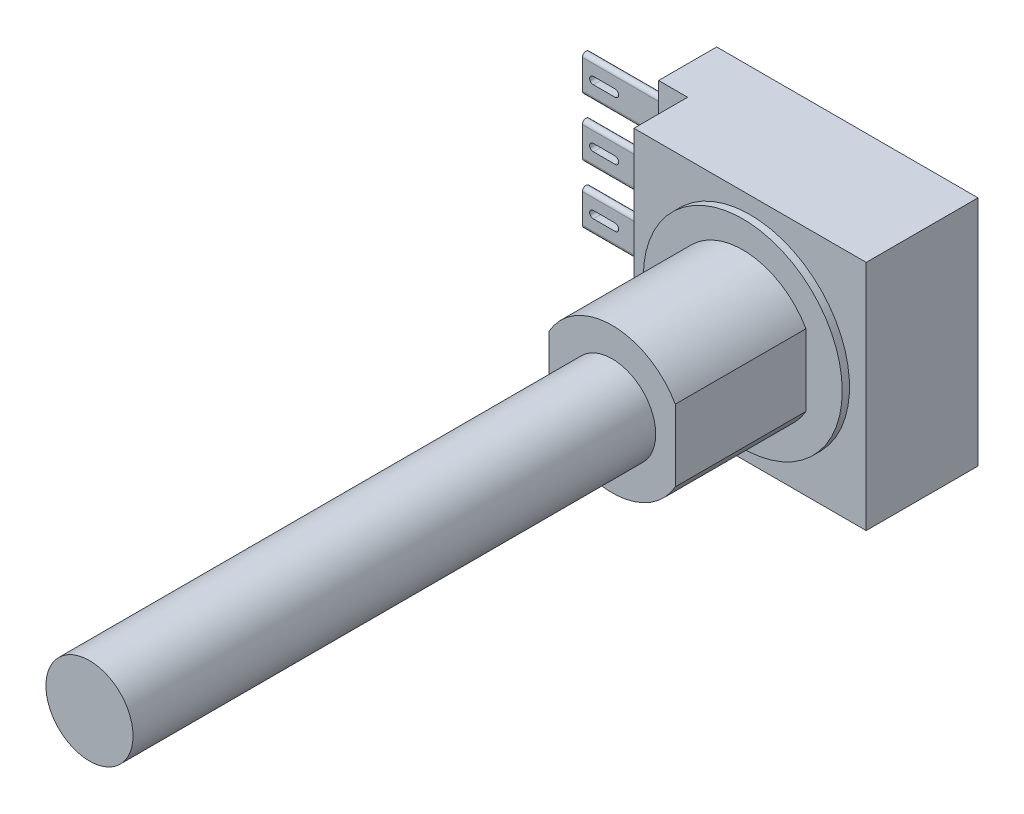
ISO-10303-21;
HEADER;
FILE_DESCRIPTION(('STEP AP214'),'2;1');
FILE_NAME('part.step','',(''),(''),'','','');
FILE_SCHEMA(('AUTOMOTIVE_DESIGN { 1 0 10303 214 1 1 1 1 }'));
ENDSEC;
DATA;
#1=APPLICATION_CONTEXT('core data for automotive mechanical design processes');
#2=APPLICATION_PROTOCOL_DEFINITION('international standard','automotive_design',2000,#1);
#3=PRODUCT_CONTEXT('',#1,'mechanical');
#4=PRODUCT('Part','Part','',(#3));
#5=PRODUCT_RELATED_PRODUCT_CATEGORY('part','',(#4));
#6=PRODUCT_DEFINITION_FORMATION('','',#4);
#7=PRODUCT_DEFINITION_CONTEXT('part definition',#1,'design');
#8=PRODUCT_DEFINITION('design','',#6,#7);
#9=PRODUCT_DEFINITION_SHAPE('','',#8);
#10=(LENGTH_UNIT() NAMED_UNIT(*) SI_UNIT(.MILLI.,.METRE.));
#11=(NAMED_UNIT(*) PLANE_ANGLE_UNIT() SI_UNIT($,.RADIAN.));
#12=(NAMED_UNIT(*) SI_UNIT($,.STERADIAN.) SOLID_ANGLE_UNIT());
#13=UNCERTAINTY_MEASURE_WITH_UNIT(LENGTH_MEASURE(1.E-05),#10,'distance_accuracy_value','');
#14=(GEOMETRIC_REPRESENTATION_CONTEXT(3) GLOBAL_UNCERTAINTY_ASSIGNED_CONTEXT((#13)) GLOBAL_UNIT_ASSIGNED_CONTEXT((#10,
#11,#12)) REPRESENTATION_CONTEXT('',''));
#15=CARTESIAN_POINT('',(0.,0.,0.));
#16=DIRECTION('',(0.,0.,1.));
#17=DIRECTION('',(1.,0.,0.));
#18=AXIS2_PLACEMENT_3D('',#15,#16,#17);
#19=CARTESIAN_POINT('',(-20.8042237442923,3.17549019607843,4.));
#20=DIRECTION('',(1.,0.,0.));
#21=DIRECTION('',(0.,1.,0.));
#22=AXIS2_PLACEMENT_3D('',#19,#20,#21);
#23=PLANE('',#22);
#24=CARTESIAN_POINT('',(-20.8042237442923,0.175490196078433,2.));
#25=DIRECTION('',(-1.,0.,0.));
#26=DIRECTION('',(0.,-1.,0.));
#27=AXIS2_PLACEMENT_3D('',#24,#25,#26);
#28=CIRCLE('',#27,0.25);
#29=CARTESIAN_POINT('',(-20.8042237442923,0.175490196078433,2.25));
#30=VERTEX_POINT('',#29);
#31=CARTESIAN_POINT('',(-20.8042237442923,0.175490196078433,1.75));
#32=VERTEX_POINT('',#31);
#33=EDGE_CURVE('E392',#30,#32,#28,.T.);
#34=ORIENTED_EDGE('',*,*,#33,.F.);
#35=DIRECTION('',(0.,1.,0.));
#36=VECTOR('',#35,1.);
#37=CARTESIAN_POINT('',(-20.8042237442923,0.175490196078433,2.25));
#38=LINE('',#37,#36);
#39=CARTESIAN_POINT('',(-20.8042237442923,-1.82450980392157,2.25));
#40=VERTEX_POINT('',#39);
#41=EDGE_CURVE('E397',#40,#30,#38,.T.);
#42=ORIENTED_EDGE('',*,*,#41,.F.);
#43=CARTESIAN_POINT('',(-20.8042237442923,-1.82450980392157,2.));
#44=DIRECTION('',(-1.,0.,0.));
#45=DIRECTION('',(0.,-1.,0.));
#46=AXIS2_PLACEMENT_3D('',#43,#44,#45);
#47=CIRCLE('',#46,0.25);
#48=CARTESIAN_POINT('',(-20.8042237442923,-1.82450980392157,1.75));
#49=VERTEX_POINT('',#48);
#50=EDGE_CURVE('E409',#49,#40,#47,.T.);
#51=ORIENTED_EDGE('',*,*,#50,.F.);
#52=DIRECTION('',(0.,-1.,0.));
#53=VECTOR('',#52,1.);
#54=CARTESIAN_POINT('',(-20.8042237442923,0.175490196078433,1.75));
#55=LINE('',#54,#53);
#56=EDGE_CURVE('E406',#32,#49,#55,.T.);
#57=ORIENTED_EDGE('',*,*,#56,.F.);
#58=EDGE_LOOP('',(#34,#42,#51,#57));
#59=FACE_BOUND('',#58,.T.);
#60=DIRECTION('',(0.,-1.,0.));
#61=VECTOR('',#60,1.);
#62=CARTESIAN_POINT('',(-20.8042237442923,3.17549019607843,0.));
#63=LINE('',#62,#61);
#64=CARTESIAN_POINT('',(-20.8042237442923,3.17549019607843,0.));
#65=VERTEX_POINT('',#64);
#66=CARTESIAN_POINT('',(-20.8042237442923,-12.8245098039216,0.));
#67=VERTEX_POINT('',#66);
#68=EDGE_CURVE('E515',#65,#67,#63,.T.);
#69=ORIENTED_EDGE('',*,*,#68,.T.);
#70=DIRECTION('',(0.,0.,-1.));
#71=VECTOR('',#70,1.);
#72=CARTESIAN_POINT('',(-20.8042237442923,-12.8245098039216,4.));
#73=LINE('',#72,#71);
#74=CARTESIAN_POINT('',(-20.8042237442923,-12.8245098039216,4.));
#75=VERTEX_POINT('',#74);
#76=EDGE_CURVE('E522',#75,#67,#73,.T.);
#77=ORIENTED_EDGE('',*,*,#76,.F.);
#78=DIRECTION('',(0.,-1.,0.));
#79=VECTOR('',#78,1.);
#80=CARTESIAN_POINT('',(-20.8042237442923,3.17549019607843,4.));
#81=LINE('',#80,#79);
#82=CARTESIAN_POINT('',(-20.8042237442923,3.17549019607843,4.));
#83=VERTEX_POINT('',#82);
#84=EDGE_CURVE('E499',#83,#75,#81,.T.);
#85=ORIENTED_EDGE('',*,*,#84,.F.);
#86=DIRECTION('',(0.,0.,-1.));
#87=VECTOR('',#86,1.);
#88=CARTESIAN_POINT('',(-20.8042237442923,3.17549019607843,4.));
#89=LINE('',#88,#87);
#90=EDGE_CURVE('E1025',#83,#65,#89,.T.);
#91=ORIENTED_EDGE('',*,*,#90,.T.);
#92=EDGE_LOOP('',(#69,#77,#85,#91));
#93=FACE_BOUND('',#92,.T.);
#94=CARTESIAN_POINT('',(-20.8042237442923,-3.82450980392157,2.));
#95=DIRECTION('',(-1.,0.,0.));
#96=DIRECTION('',(0.,-1.,0.));
#97=AXIS2_PLACEMENT_3D('',#94,#95,#96);
#98=CIRCLE('',#97,0.25);
#99=CARTESIAN_POINT('',(-20.8042237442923,-3.82450980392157,2.25));
#100=VERTEX_POINT('',#99);
#101=CARTESIAN_POINT('',(-20.8042237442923,-3.82450980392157,1.75));
#102=VERTEX_POINT('',#101);
#103=EDGE_CURVE('E425',#100,#102,#98,.T.);
#104=ORIENTED_EDGE('',*,*,#103,.F.);
#105=DIRECTION('',(0.,1.,0.));
#106=VECTOR('',#105,1.);
#107=CARTESIAN_POINT('',(-20.8042237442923,-3.82450980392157,2.25));
#108=LINE('',#107,#106);
#109=CARTESIAN_POINT('',(-20.8042237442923,-5.82450980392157,2.25));
#110=VERTEX_POINT('',#109);
#111=EDGE_CURVE('E430',#110,#100,#108,.T.);
#112=ORIENTED_EDGE('',*,*,#111,.F.);
#113=CARTESIAN_POINT('',(-20.8042237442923,-5.82450980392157,2.));
#114=DIRECTION('',(-1.,0.,0.));
#115=DIRECTION('',(0.,-1.,0.));
#116=AXIS2_PLACEMENT_3D('',#113,#114,#115);
#117=CIRCLE('',#116,0.25);
#118=CARTESIAN_POINT('',(-20.8042237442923,-5.82450980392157,1.75));
#119=VERTEX_POINT('',#118);
#120=EDGE_CURVE('E442',#119,#110,#117,.T.);
#121=ORIENTED_EDGE('',*,*,#120,.F.);
#122=DIRECTION('',(0.,-1.,0.));
#123=VECTOR('',#122,1.);
#124=CARTESIAN_POINT('',(-20.8042237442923,-3.82450980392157,1.75));
#125=LINE('',#124,#123);
#126=EDGE_CURVE('E439',#102,#119,#125,.T.);
#127=ORIENTED_EDGE('',*,*,#126,.F.);
#128=EDGE_LOOP('',(#104,#112,#121,#127));
#129=FACE_BOUND('',#128,.T.);
#130=CARTESIAN_POINT('',(-20.8042237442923,-7.82450980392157,2.));
#131=DIRECTION('',(-1.,0.,0.));
#132=DIRECTION('',(0.,-1.,0.));
#133=AXIS2_PLACEMENT_3D('',#130,#131,#132);
#134=CIRCLE('',#133,0.250000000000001);
#135=CARTESIAN_POINT('',(-20.8042237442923,-7.82450980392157,2.25));
#136=VERTEX_POINT('',#135);
#137=CARTESIAN_POINT('',(-20.8042237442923,-7.82450980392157,1.75));
#138=VERTEX_POINT('',#137);
#139=EDGE_CURVE('E359',#136,#138,#134,.T.);
#140=ORIENTED_EDGE('',*,*,#139,.F.);
#141=DIRECTION('',(0.,1.,0.));
#142=VECTOR('',#141,1.);
#143=CARTESIAN_POINT('',(-20.8042237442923,-7.82450980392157,2.25));
#144=LINE('',#143,#142);
#145=CARTESIAN_POINT('',(-20.8042237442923,-9.82450980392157,2.25));
#146=VERTEX_POINT('',#145);
#147=EDGE_CURVE('E364',#146,#136,#144,.T.);
#148=ORIENTED_EDGE('',*,*,#147,.F.);
#149=CARTESIAN_POINT('',(-20.8042237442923,-9.82450980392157,2.));
#150=DIRECTION('',(-1.,0.,0.));
#151=DIRECTION('',(0.,-1.,0.));
#152=AXIS2_PLACEMENT_3D('',#149,#150,#151);
#153=CIRCLE('',#152,0.25);
#154=CARTESIAN_POINT('',(-20.8042237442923,-9.82450980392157,1.75));
#155=VERTEX_POINT('',#154);
#156=EDGE_CURVE('E376',#155,#146,#153,.T.);
#157=ORIENTED_EDGE('',*,*,#156,.F.);
#158=DIRECTION('',(0.,-1.,0.));
#159=VECTOR('',#158,1.);
#160=CARTESIAN_POINT('',(-20.8042237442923,-7.82450980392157,1.75));
#161=LINE('',#160,#159);
#162=EDGE_CURVE('E373',#138,#155,#161,.T.);
#163=ORIENTED_EDGE('',*,*,#162,.F.);
#164=EDGE_LOOP('',(#140,#148,#157,#163));
#165=FACE_BOUND('',#164,.T.);
#166=ADVANCED_FACE('F38',(#59,#93,#129,#165),#23,.F.);
#167=CARTESIAN_POINT('',(-10.8042237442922,-4.82450980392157,17.2));
#168=DIRECTION('',(0.,0.,1.));
#169=DIRECTION('',(1.,0.,0.));
#170=AXIS2_PLACEMENT_3D('',#167,#168,#169);
#171=PLANE('',#170);
#172=CARTESIAN_POINT('',(-10.8042237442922,-4.82450980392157,17.2));
#173=DIRECTION('',(0.,0.,1.));
#174=DIRECTION('',(1.,0.,0.));
#175=AXIS2_PLACEMENT_3D('',#172,#173,#174);
#176=CIRCLE('',#175,3.);
#177=CARTESIAN_POINT('',(-7.80422374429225,-4.82450980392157,17.2));
#178=VERTEX_POINT('',#177);
#179=EDGE_CURVE('E461',#178,#178,#176,.T.);
#180=ORIENTED_EDGE('',*,*,#179,.F.);
#181=EDGE_LOOP('',(#180));
#182=FACE_BOUND('',#181,.T.);
#183=CARTESIAN_POINT('',(-10.8042237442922,-4.82450980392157,17.2));
#184=DIRECTION('',(0.,0.,1.));
#185=DIRECTION('',(1.,0.,0.));
#186=AXIS2_PLACEMENT_3D('',#183,#184,#185);
#187=CIRCLE('',#186,5.);
#188=CARTESIAN_POINT('',(-15.1542237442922,-7.28976841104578,17.2));
#189=VERTEX_POINT('',#188);
#190=CARTESIAN_POINT('',(-6.45422374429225,-7.28976841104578,17.2));
#191=VERTEX_POINT('',#190);
#192=EDGE_CURVE('E479',#189,#191,#187,.T.);
#193=ORIENTED_EDGE('',*,*,#192,.T.);
#194=DIRECTION('',(0.,1.,0.));
#195=VECTOR('',#194,1.);
#196=CARTESIAN_POINT('',(-6.45422374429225,0.675490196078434,17.2));
#197=LINE('',#196,#195);
#198=CARTESIAN_POINT('',(-6.45422374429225,-2.35925119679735,17.2));
#199=VERTEX_POINT('',#198);
#200=EDGE_CURVE('E464',#191,#199,#197,.T.);
#201=ORIENTED_EDGE('',*,*,#200,.T.);
#202=CARTESIAN_POINT('',(-15.1542237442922,-2.35925119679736,17.2));
#203=VERTEX_POINT('',#202);
#204=EDGE_CURVE('E475',#199,#203,#187,.T.);
#205=ORIENTED_EDGE('',*,*,#204,.T.);
#206=DIRECTION('',(0.,-1.,0.));
#207=VECTOR('',#206,1.);
#208=CARTESIAN_POINT('',(-15.1542237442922,0.675490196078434,17.2));
#209=LINE('',#208,#207);
#210=EDGE_CURVE('E458',#203,#189,#209,.T.);
#211=ORIENTED_EDGE('',*,*,#210,.T.);
#212=EDGE_LOOP('',(#193,#201,#205,#211));
#213=FACE_BOUND('',#212,.T.);
#214=ADVANCED_FACE('F535',(#182,#213),#171,.T.);
#215=CARTESIAN_POINT('',(-10.8042237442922,-4.82450980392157,17.2));
#216=DIRECTION('',(0.,0.,-1.));
#217=DIRECTION('',(-1.,0.,0.));
#218=AXIS2_PLACEMENT_3D('',#215,#216,#217);
#219=CYLINDRICAL_SURFACE('',#218,5.);
#220=DIRECTION('',(0.,0.,-1.));
#221=VECTOR('',#220,1.);
#222=CARTESIAN_POINT('',(-6.45422374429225,-7.28976841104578,17.2));
#223=LINE('',#222,#221);
#224=CARTESIAN_POINT('',(-6.45422374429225,-7.28976841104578,8.2));
#225=VERTEX_POINT('',#224);
#226=EDGE_CURVE('E12',#191,#225,#223,.T.);
#227=ORIENTED_EDGE('',*,*,#226,.F.);
#228=ORIENTED_EDGE('',*,*,#192,.F.);
#229=DIRECTION('',(0.,0.,-1.));
#230=VECTOR('',#229,1.);
#231=CARTESIAN_POINT('',(-15.1542237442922,-7.28976841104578,17.2));
#232=LINE('',#231,#230);
#233=CARTESIAN_POINT('',(-15.1542237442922,-7.28976841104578,8.2));
#234=VERTEX_POINT('',#233);
#235=EDGE_CURVE('E521',#234,#189,#232,.F.);
#236=ORIENTED_EDGE('',*,*,#235,.F.);
#237=CARTESIAN_POINT('',(-10.8042237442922,-4.82450980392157,8.2));
#238=DIRECTION('',(0.,0.,1.));
#239=DIRECTION('',(1.,0.,0.));
#240=AXIS2_PLACEMENT_3D('',#237,#238,#239);
#241=CIRCLE('',#240,5.);
#242=EDGE_CURVE('E472',#234,#225,#241,.T.);
#243=ORIENTED_EDGE('',*,*,#242,.T.);
#244=EDGE_LOOP('',(#227,#228,#236,#243));
#245=FACE_BOUND('',#244,.T.);
#246=ADVANCED_FACE('F543',(#245),#219,.T.);
#247=DIRECTION('',(0.,0.,-1.));
#248=VECTOR('',#247,1.);
#249=CARTESIAN_POINT('',(-6.45422374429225,-2.35925119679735,17.2));
#250=LINE('',#249,#248);
#251=CARTESIAN_POINT('',(-6.45422374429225,-2.35925119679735,8.2));
#252=VERTEX_POINT('',#251);
#253=EDGE_CURVE('E45',#252,#199,#250,.F.);
#254=ORIENTED_EDGE('',*,*,#253,.F.);
#255=CARTESIAN_POINT('',(-15.1542237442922,-2.35925119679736,8.2));
#256=VERTEX_POINT('',#255);
#257=EDGE_CURVE('E480',#252,#256,#241,.T.);
#258=ORIENTED_EDGE('',*,*,#257,.T.);
#259=DIRECTION('',(0.,0.,-1.));
#260=VECTOR('',#259,1.);
#261=CARTESIAN_POINT('',(-15.1542237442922,-2.35925119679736,17.2));
#262=LINE('',#261,#260);
#263=EDGE_CURVE('E524',#203,#256,#262,.T.);
#264=ORIENTED_EDGE('',*,*,#263,.F.);
#265=ORIENTED_EDGE('',*,*,#204,.F.);
#266=EDGE_LOOP('',(#254,#258,#264,#265));
#267=FACE_BOUND('',#266,.T.);
#268=ADVANCED_FACE('F538',(#267),#219,.T.);
#269=CARTESIAN_POINT('',(-10.8042237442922,-4.82450980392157,8.2));
#270=DIRECTION('',(0.,0.,1.));
#271=DIRECTION('',(1.,0.,0.));
#272=AXIS2_PLACEMENT_3D('',#269,#270,#271);
#273=PLANE('',#272);
#274=DIRECTION('',(0.,-1.,0.));
#275=VECTOR('',#274,1.);
#276=CARTESIAN_POINT('',(-6.45422374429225,0.675490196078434,8.2));
#277=LINE('',#276,#275);
#278=EDGE_CURVE('E459',#252,#225,#277,.T.);
#279=ORIENTED_EDGE('',*,*,#278,.T.);
#280=ORIENTED_EDGE('',*,*,#242,.F.);
#281=DIRECTION('',(0.,1.,0.));
#282=VECTOR('',#281,1.);
#283=CARTESIAN_POINT('',(-15.1542237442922,0.675490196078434,8.2));
#284=LINE('',#283,#282);
#285=EDGE_CURVE('E462',#234,#256,#284,.T.);
#286=ORIENTED_EDGE('',*,*,#285,.T.);
#287=ORIENTED_EDGE('',*,*,#257,.F.);
#288=EDGE_LOOP('',(#279,#280,#286,#287));
#289=FACE_BOUND('',#288,.T.);
#290=CARTESIAN_POINT('',(-10.8042237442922,-4.82450980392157,8.2));
#291=DIRECTION('',(0.,0.,1.));
#292=DIRECTION('',(1.,0.,0.));
#293=AXIS2_PLACEMENT_3D('',#290,#291,#292);
#294=CIRCLE('',#293,6.85);
#295=CARTESIAN_POINT('',(-3.95422374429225,-4.82450980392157,8.2));
#296=VERTEX_POINT('',#295);
#297=EDGE_CURVE('E478',#296,#296,#294,.T.);
#298=ORIENTED_EDGE('',*,*,#297,.T.);
#299=EDGE_LOOP('',(#298));
#300=FACE_BOUND('',#299,.T.);
#301=ADVANCED_FACE('F547',(#289,#300),#273,.T.);
#302=CARTESIAN_POINT('',(0.,0.,7.7));
#303=DIRECTION('',(0.,0.,-1.));
#304=DIRECTION('',(-1.,0.,0.));
#305=AXIS2_PLACEMENT_3D('',#302,#303,#304);
#306=PLANE('',#305);
#307=DIRECTION('',(0.,1.,0.));
#308=VECTOR('',#307,1.);
#309=CARTESIAN_POINT('',(-2.80422374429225,3.17549019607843,7.7));
#310=LINE('',#309,#308);
#311=CARTESIAN_POINT('',(-2.80422374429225,-12.8245098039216,7.7));
#312=VERTEX_POINT('',#311);
#313=CARTESIAN_POINT('',(-2.80422374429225,3.17549019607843,7.7));
#314=VERTEX_POINT('',#313);
#315=EDGE_CURVE('E486',#312,#314,#310,.T.);
#316=ORIENTED_EDGE('',*,*,#315,.T.);
#317=DIRECTION('',(-1.,0.,0.));
#318=VECTOR('',#317,1.);
#319=CARTESIAN_POINT('',(-2.80422374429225,3.17549019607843,7.7));
#320=LINE('',#319,#318);
#321=CARTESIAN_POINT('',(-18.8042237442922,3.17549019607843,7.7));
#322=VERTEX_POINT('',#321);
#323=EDGE_CURVE('E489',#314,#322,#320,.T.);
#324=ORIENTED_EDGE('',*,*,#323,.T.);
#325=DIRECTION('',(0.,-1.,0.));
#326=VECTOR('',#325,1.);
#327=CARTESIAN_POINT('',(-18.8042237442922,3.17549019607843,7.7));
#328=LINE('',#327,#326);
#329=CARTESIAN_POINT('',(-18.8042237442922,-12.8245098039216,7.7));
#330=VERTEX_POINT('',#329);
#331=EDGE_CURVE('E491',#322,#330,#328,.T.);
#332=ORIENTED_EDGE('',*,*,#331,.T.);
#333=DIRECTION('',(1.,0.,0.));
#334=VECTOR('',#333,1.);
#335=CARTESIAN_POINT('',(-2.80422374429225,-12.8245098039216,7.7));
#336=LINE('',#335,#334);
#337=EDGE_CURVE('E493',#330,#312,#336,.T.);
#338=ORIENTED_EDGE('',*,*,#337,.T.);
#339=EDGE_LOOP('',(#316,#324,#332,#338));
#340=FACE_BOUND('',#339,.T.);
#341=CARTESIAN_POINT('',(-10.8042237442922,-4.82450980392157,7.7));
#342=DIRECTION('',(0.,0.,-1.));
#343=DIRECTION('',(-1.,0.,0.));
#344=AXIS2_PLACEMENT_3D('',#341,#342,#343);
#345=CIRCLE('',#344,6.85);
#346=CARTESIAN_POINT('',(-17.6542237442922,-4.82450980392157,7.7));
#347=VERTEX_POINT('',#346);
#348=EDGE_CURVE('E518',#347,#347,#345,.F.);
#349=ORIENTED_EDGE('',*,*,#348,.F.);
#350=EDGE_LOOP('',(#349));
#351=FACE_BOUND('',#350,.T.);
#352=ADVANCED_FACE('F550',(#340,#351),#306,.F.);
#353=CARTESIAN_POINT('',(-20.8042237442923,-12.8245098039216,4.));
#354=DIRECTION('',(0.,1.,0.));
#355=DIRECTION('',(0.,0.,1.));
#356=AXIS2_PLACEMENT_3D('',#353,#354,#355);
#357=PLANE('',#356);
#358=DIRECTION('',(1.,0.,0.));
#359=VECTOR('',#358,1.);
#360=CARTESIAN_POINT('',(-20.8042237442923,-12.8245098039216,0.));
#361=LINE('',#360,#359);
#362=CARTESIAN_POINT('',(-2.80422374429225,-12.8245098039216,0.));
#363=VERTEX_POINT('',#362);
#364=EDGE_CURVE('E1016',#67,#363,#361,.T.);
#365=ORIENTED_EDGE('',*,*,#364,.T.);
#366=DIRECTION('',(0.,0.,-1.));
#367=VECTOR('',#366,1.);
#368=CARTESIAN_POINT('',(-2.80422374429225,-12.8245098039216,4.));
#369=LINE('',#368,#367);
#370=EDGE_CURVE('E1030',#312,#363,#369,.T.);
#371=ORIENTED_EDGE('',*,*,#370,.F.);
#372=ORIENTED_EDGE('',*,*,#337,.F.);
#373=DIRECTION('',(0.,0.,-1.));
#374=VECTOR('',#373,1.);
#375=CARTESIAN_POINT('',(-18.8042237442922,-12.8245098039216,7.7));
#376=LINE('',#375,#374);
#377=CARTESIAN_POINT('',(-18.8042237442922,-12.8245098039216,4.));
#378=VERTEX_POINT('',#377);
#379=EDGE_CURVE('E496',#330,#378,#376,.T.);
#380=ORIENTED_EDGE('',*,*,#379,.T.);
#381=DIRECTION('',(1.,0.,0.));
#382=VECTOR('',#381,1.);
#383=CARTESIAN_POINT('',(-20.8042237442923,-12.8245098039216,4.));
#384=LINE('',#383,#382);
#385=EDGE_CURVE('E1033',#75,#378,#384,.T.);
#386=ORIENTED_EDGE('',*,*,#385,.F.);
#387=ORIENTED_EDGE('',*,*,#76,.T.);
#388=EDGE_LOOP('',(#365,#371,#372,#380,#386,#387));
#389=FACE_BOUND('',#388,.T.);
#390=ADVANCED_FACE('F563',(#389),#357,.F.);
#391=CARTESIAN_POINT('',(-2.80422374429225,3.17549019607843,4.));
#392=DIRECTION('',(-1.,0.,0.));
#393=DIRECTION('',(0.,-1.,0.));
#394=AXIS2_PLACEMENT_3D('',#391,#392,#393);
#395=PLANE('',#394);
#396=DIRECTION('',(0.,1.,0.));
#397=VECTOR('',#396,1.);
#398=CARTESIAN_POINT('',(-2.80422374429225,3.17549019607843,0.));
#399=LINE('',#398,#397);
#400=CARTESIAN_POINT('',(-2.80422374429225,3.17549019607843,0.));
#401=VERTEX_POINT('',#400);
#402=EDGE_CURVE('E1019',#363,#401,#399,.T.);
#403=ORIENTED_EDGE('',*,*,#402,.T.);
#404=DIRECTION('',(0.,0.,-1.));
#405=VECTOR('',#404,1.);
#406=CARTESIAN_POINT('',(-2.80422374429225,3.17549019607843,4.));
#407=LINE('',#406,#405);
#408=EDGE_CURVE('E1027',#314,#401,#407,.T.);
#409=ORIENTED_EDGE('',*,*,#408,.F.);
#410=ORIENTED_EDGE('',*,*,#315,.F.);
#411=ORIENTED_EDGE('',*,*,#370,.T.);
#412=EDGE_LOOP('',(#403,#409,#410,#411));
#413=FACE_BOUND('',#412,.T.);
#414=ADVANCED_FACE('F569',(#413),#395,.F.);
#415=CARTESIAN_POINT('',(-20.8042237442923,3.17549019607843,4.));
#416=DIRECTION('',(0.,-1.,0.));
#417=DIRECTION('',(0.,0.,-1.));
#418=AXIS2_PLACEMENT_3D('',#415,#416,#417);
#419=PLANE('',#418);
#420=DIRECTION('',(-1.,0.,0.));
#421=VECTOR('',#420,1.);
#422=CARTESIAN_POINT('',(-20.8042237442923,3.17549019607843,0.));
#423=LINE('',#422,#421);
#424=EDGE_CURVE('E1015',#401,#65,#423,.T.);
#425=ORIENTED_EDGE('',*,*,#424,.T.);
#426=ORIENTED_EDGE('',*,*,#90,.F.);
#427=DIRECTION('',(-1.,0.,0.));
#428=VECTOR('',#427,1.);
#429=CARTESIAN_POINT('',(-20.8042237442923,3.17549019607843,4.));
#430=LINE('',#429,#428);
#431=CARTESIAN_POINT('',(-18.8042237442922,3.17549019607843,4.));
#432=VERTEX_POINT('',#431);
#433=EDGE_CURVE('E505',#432,#83,#430,.T.);
#434=ORIENTED_EDGE('',*,*,#433,.F.);
#435=DIRECTION('',(0.,0.,-1.));
#436=VECTOR('',#435,1.);
#437=CARTESIAN_POINT('',(-18.8042237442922,3.17549019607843,7.7));
#438=LINE('',#437,#436);
#439=EDGE_CURVE('E510',#322,#432,#438,.T.);
#440=ORIENTED_EDGE('',*,*,#439,.F.);
#441=ORIENTED_EDGE('',*,*,#323,.F.);
#442=ORIENTED_EDGE('',*,*,#408,.T.);
#443=EDGE_LOOP('',(#425,#426,#434,#440,#441,#442));
#444=FACE_BOUND('',#443,.T.);
#445=ADVANCED_FACE('F974',(#444),#419,.F.);
#446=CARTESIAN_POINT('',(0.,0.,4.));
#447=DIRECTION('',(0.,0.,1.));
#448=DIRECTION('',(1.,0.,0.));
#449=AXIS2_PLACEMENT_3D('',#446,#447,#448);
#450=PLANE('',#449);
#451=DIRECTION('',(0.,-1.,0.));
#452=VECTOR('',#451,1.);
#453=CARTESIAN_POINT('',(-18.8042237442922,3.17549019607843,4.));
#454=LINE('',#453,#452);
#455=EDGE_CURVE('E485',#432,#378,#454,.T.);
#456=ORIENTED_EDGE('',*,*,#455,.F.);
#457=ORIENTED_EDGE('',*,*,#433,.T.);
#458=ORIENTED_EDGE('',*,*,#84,.T.);
#459=ORIENTED_EDGE('',*,*,#385,.T.);
#460=EDGE_LOOP('',(#456,#457,#458,#459));
#461=FACE_BOUND('',#460,.T.);
#462=ADVANCED_FACE('F969',(#461),#450,.T.);
#463=CARTESIAN_POINT('',(0.,0.,0.));
#464=DIRECTION('',(0.,0.,1.));
#465=DIRECTION('',(1.,0.,0.));
#466=AXIS2_PLACEMENT_3D('',#463,#464,#465);
#467=PLANE('',#466);
#468=ORIENTED_EDGE('',*,*,#68,.F.);
#469=ORIENTED_EDGE('',*,*,#424,.F.);
#470=ORIENTED_EDGE('',*,*,#402,.F.);
#471=ORIENTED_EDGE('',*,*,#364,.F.);
#472=EDGE_LOOP('',(#468,#469,#470,#471));
#473=FACE_BOUND('',#472,.T.);
#474=ADVANCED_FACE('F962',(#473),#467,.F.);
#475=CARTESIAN_POINT('',(-18.8042237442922,3.17549019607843,7.7));
#476=DIRECTION('',(1.,0.,0.));
#477=DIRECTION('',(0.,1.,0.));
#478=AXIS2_PLACEMENT_3D('',#475,#476,#477);
#479=PLANE('',#478);
#480=ORIENTED_EDGE('',*,*,#455,.T.);
#481=ORIENTED_EDGE('',*,*,#379,.F.);
#482=ORIENTED_EDGE('',*,*,#331,.F.);
#483=ORIENTED_EDGE('',*,*,#439,.T.);
#484=EDGE_LOOP('',(#480,#481,#482,#483));
#485=FACE_BOUND('',#484,.T.);
#486=ADVANCED_FACE('F558',(#485),#479,.F.);
#487=CARTESIAN_POINT('',(-10.8042237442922,-4.82450980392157,8.2));
#488=DIRECTION('',(0.,0.,-1.));
#489=DIRECTION('',(-1.,0.,0.));
#490=AXIS2_PLACEMENT_3D('',#487,#488,#489);
#491=CYLINDRICAL_SURFACE('',#490,6.85);
#492=ORIENTED_EDGE('',*,*,#297,.F.);
#493=EDGE_LOOP('',(#492));
#494=FACE_BOUND('',#493,.T.);
#495=ORIENTED_EDGE('',*,*,#348,.T.);
#496=EDGE_LOOP('',(#495));
#497=FACE_BOUND('',#496,.T.);
#498=ADVANCED_FACE('F554',(#494,#497),#491,.T.);
#499=CARTESIAN_POINT('',(-10.8042237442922,-4.82450980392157,53.2));
#500=DIRECTION('',(0.,0.,-1.));
#501=DIRECTION('',(-1.,0.,0.));
#502=AXIS2_PLACEMENT_3D('',#499,#500,#501);
#503=CYLINDRICAL_SURFACE('',#502,3.);
#504=CARTESIAN_POINT('',(-10.8042237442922,-4.82450980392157,53.2));
#505=DIRECTION('',(0.,0.,1.));
#506=DIRECTION('',(1.,0.,0.));
#507=AXIS2_PLACEMENT_3D('',#504,#505,#506);
#508=CIRCLE('',#507,3.);
#509=CARTESIAN_POINT('',(-7.80422374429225,-4.82450980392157,53.2));
#510=VERTEX_POINT('',#509);
#511=EDGE_CURVE('E469',#510,#510,#508,.T.);
#512=ORIENTED_EDGE('',*,*,#511,.F.);
#513=EDGE_LOOP('',(#512));
#514=FACE_BOUND('',#513,.T.);
#515=ORIENTED_EDGE('',*,*,#179,.T.);
#516=EDGE_LOOP('',(#515));
#517=FACE_BOUND('',#516,.T.);
#518=ADVANCED_FACE('F557',(#514,#517),#503,.T.);
#519=CARTESIAN_POINT('',(-10.8042237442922,-4.82450980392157,53.2));
#520=DIRECTION('',(0.,0.,1.));
#521=DIRECTION('',(1.,0.,0.));
#522=AXIS2_PLACEMENT_3D('',#519,#520,#521);
#523=PLANE('',#522);
#524=ORIENTED_EDGE('',*,*,#511,.T.);
#525=EDGE_LOOP('',(#524));
#526=FACE_BOUND('',#525,.T.);
#527=ADVANCED_FACE('F654',(#526),#523,.T.);
#528=CARTESIAN_POINT('',(-6.45422374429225,0.675490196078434,-17.9163292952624));
#529=DIRECTION('',(1.,0.,0.));
#530=DIRECTION('',(0.,1.,0.));
#531=AXIS2_PLACEMENT_3D('',#528,#529,#530);
#532=PLANE('',#531);
#533=ORIENTED_EDGE('',*,*,#226,.T.);
#534=ORIENTED_EDGE('',*,*,#278,.F.);
#535=ORIENTED_EDGE('',*,*,#253,.T.);
#536=ORIENTED_EDGE('',*,*,#200,.F.);
#537=EDGE_LOOP('',(#533,#534,#535,#536));
#538=FACE_BOUND('',#537,.T.);
#539=ADVANCED_FACE('F528',(#538),#532,.T.);
#540=CARTESIAN_POINT('',(-15.1542237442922,0.675490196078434,-17.9163292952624));
#541=DIRECTION('',(-1.,0.,0.));
#542=DIRECTION('',(0.,-1.,0.));
#543=AXIS2_PLACEMENT_3D('',#540,#541,#542);
#544=PLANE('',#543);
#545=ORIENTED_EDGE('',*,*,#263,.T.);
#546=ORIENTED_EDGE('',*,*,#285,.F.);
#547=ORIENTED_EDGE('',*,*,#235,.T.);
#548=ORIENTED_EDGE('',*,*,#210,.F.);
#549=EDGE_LOOP('',(#545,#546,#547,#548));
#550=FACE_BOUND('',#549,.T.);
#551=ADVANCED_FACE('F540',(#550),#544,.T.);
#552=CARTESIAN_POINT('',(-27.8042237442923,-3.82450980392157,2.));
#553=DIRECTION('',(1.,0.,0.));
#554=DIRECTION('',(0.,1.,0.));
#555=AXIS2_PLACEMENT_3D('',#552,#553,#554);
#556=CYLINDRICAL_SURFACE('',#555,0.25);
#557=ORIENTED_EDGE('',*,*,#103,.T.);
#558=DIRECTION('',(1.,0.,0.));
#559=VECTOR('',#558,1.);
#560=CARTESIAN_POINT('',(-27.8042237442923,-3.82450980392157,1.75));
#561=LINE('',#560,#559);
#562=CARTESIAN_POINT('',(-27.8042237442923,-3.82450980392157,1.75));
#563=VERTEX_POINT('',#562);
#564=EDGE_CURVE('E455',#563,#102,#561,.T.);
#565=ORIENTED_EDGE('',*,*,#564,.F.);
#566=CARTESIAN_POINT('',(-27.8042237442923,-3.82450980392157,2.));
#567=DIRECTION('',(-1.,0.,0.));
#568=DIRECTION('',(0.,-1.,0.));
#569=AXIS2_PLACEMENT_3D('',#566,#567,#568);
#570=CIRCLE('',#569,0.25);
#571=CARTESIAN_POINT('',(-27.8042237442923,-3.82450980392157,2.25));
#572=VERTEX_POINT('',#571);
#573=EDGE_CURVE('E426',#572,#563,#570,.T.);
#574=ORIENTED_EDGE('',*,*,#573,.F.);
#575=DIRECTION('',(1.,0.,0.));
#576=VECTOR('',#575,1.);
#577=CARTESIAN_POINT('',(-27.8042237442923,-3.82450980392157,2.25));
#578=LINE('',#577,#576);
#579=EDGE_CURVE('E436',#572,#100,#578,.T.);
#580=ORIENTED_EDGE('',*,*,#579,.T.);
#581=EDGE_LOOP('',(#557,#565,#574,#580));
#582=FACE_BOUND('',#581,.T.);
#583=ADVANCED_FACE('F647',(#582),#556,.T.);
#584=CARTESIAN_POINT('',(-27.8042237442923,-3.82450980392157,1.75));
#585=DIRECTION('',(0.,0.,1.));
#586=DIRECTION('',(0.,-1.,0.));
#587=AXIS2_PLACEMENT_3D('',#584,#585,#586);
#588=PLANE('',#587);
#589=DIRECTION('',(-1.,0.,0.));
#590=VECTOR('',#589,1.);
#591=CARTESIAN_POINT('',(-27.8042237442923,-4.57450980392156,1.75));
#592=LINE('',#591,#590);
#593=CARTESIAN_POINT('',(-25.5519718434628,-4.57450980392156,1.75));
#594=VERTEX_POINT('',#593);
#595=CARTESIAN_POINT('',(-27.0519718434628,-4.57450980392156,1.75));
#596=VERTEX_POINT('',#595);
#597=EDGE_CURVE('E353',#594,#596,#592,.T.);
#598=ORIENTED_EDGE('',*,*,#597,.T.);
#599=CARTESIAN_POINT('',(-27.0519718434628,-4.82450980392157,1.75));
#600=DIRECTION('',(0.,0.,1.));
#601=DIRECTION('',(0.,-1.,0.));
#602=AXIS2_PLACEMENT_3D('',#599,#600,#601);
#603=CIRCLE('',#602,0.250000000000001);
#604=CARTESIAN_POINT('',(-27.0519718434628,-5.07450980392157,1.75));
#605=VERTEX_POINT('',#604);
#606=EDGE_CURVE('E356',#596,#605,#603,.T.);
#607=ORIENTED_EDGE('',*,*,#606,.T.);
#608=DIRECTION('',(1.,0.,0.));
#609=VECTOR('',#608,1.);
#610=CARTESIAN_POINT('',(-27.8042237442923,-5.07450980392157,1.75));
#611=LINE('',#610,#609);
#612=CARTESIAN_POINT('',(-25.5519718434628,-5.07450980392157,1.75));
#613=VERTEX_POINT('',#612);
#614=EDGE_CURVE('E341',#605,#613,#611,.T.);
#615=ORIENTED_EDGE('',*,*,#614,.T.);
#616=CARTESIAN_POINT('',(-25.5519718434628,-4.82450980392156,1.75));
#617=DIRECTION('',(0.,0.,1.));
#618=DIRECTION('',(0.,-1.,0.));
#619=AXIS2_PLACEMENT_3D('',#616,#617,#618);
#620=CIRCLE('',#619,0.250000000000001);
#621=EDGE_CURVE('E350',#613,#594,#620,.T.);
#622=ORIENTED_EDGE('',*,*,#621,.T.);
#623=EDGE_LOOP('',(#598,#607,#615,#622));
#624=FACE_BOUND('',#623,.T.);
#625=ORIENTED_EDGE('',*,*,#126,.T.);
#626=DIRECTION('',(1.,0.,0.));
#627=VECTOR('',#626,1.);
#628=CARTESIAN_POINT('',(-27.8042237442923,-5.82450980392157,1.75));
#629=LINE('',#628,#627);
#630=CARTESIAN_POINT('',(-27.8042237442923,-5.82450980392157,1.75));
#631=VERTEX_POINT('',#630);
#632=EDGE_CURVE('E452',#631,#119,#629,.T.);
#633=ORIENTED_EDGE('',*,*,#632,.F.);
#634=DIRECTION('',(0.,-1.,0.));
#635=VECTOR('',#634,1.);
#636=CARTESIAN_POINT('',(-27.8042237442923,-3.82450980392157,1.75));
#637=LINE('',#636,#635);
#638=EDGE_CURVE('E429',#563,#631,#637,.T.);
#639=ORIENTED_EDGE('',*,*,#638,.F.);
#640=ORIENTED_EDGE('',*,*,#564,.T.);
#641=EDGE_LOOP('',(#625,#633,#639,#640));
#642=FACE_BOUND('',#641,.T.);
#643=ADVANCED_FACE('F643',(#624,#642),#588,.F.);
#644=CARTESIAN_POINT('',(-27.8042237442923,-5.82450980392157,2.));
#645=DIRECTION('',(1.,0.,0.));
#646=DIRECTION('',(0.,1.,0.));
#647=AXIS2_PLACEMENT_3D('',#644,#645,#646);
#648=CYLINDRICAL_SURFACE('',#647,0.25);
#649=ORIENTED_EDGE('',*,*,#120,.T.);
#650=DIRECTION('',(1.,0.,0.));
#651=VECTOR('',#650,1.);
#652=CARTESIAN_POINT('',(-27.8042237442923,-5.82450980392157,2.25));
#653=LINE('',#652,#651);
#654=CARTESIAN_POINT('',(-27.8042237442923,-5.82450980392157,2.25));
#655=VERTEX_POINT('',#654);
#656=EDGE_CURVE('E449',#655,#110,#653,.T.);
#657=ORIENTED_EDGE('',*,*,#656,.F.);
#658=CARTESIAN_POINT('',(-27.8042237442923,-5.82450980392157,2.));
#659=DIRECTION('',(-1.,0.,0.));
#660=DIRECTION('',(0.,-1.,0.));
#661=AXIS2_PLACEMENT_3D('',#658,#659,#660);
#662=CIRCLE('',#661,0.25);
#663=EDGE_CURVE('E432',#631,#655,#662,.T.);
#664=ORIENTED_EDGE('',*,*,#663,.F.);
#665=ORIENTED_EDGE('',*,*,#632,.T.);
#666=EDGE_LOOP('',(#649,#657,#664,#665));
#667=FACE_BOUND('',#666,.T.);
#668=ADVANCED_FACE('F639',(#667),#648,.T.);
#669=CARTESIAN_POINT('',(-27.8042237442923,-3.82450980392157,2.25));
#670=DIRECTION('',(0.,0.,-1.));
#671=DIRECTION('',(0.,1.,0.));
#672=AXIS2_PLACEMENT_3D('',#669,#670,#671);
#673=PLANE('',#672);
#674=DIRECTION('',(1.,0.,0.));
#675=VECTOR('',#674,1.);
#676=CARTESIAN_POINT('',(-27.0519718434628,-5.07450980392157,2.25));
#677=LINE('',#676,#675);
#678=CARTESIAN_POINT('',(-27.0519718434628,-5.07450980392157,2.25));
#679=VERTEX_POINT('',#678);
#680=CARTESIAN_POINT('',(-25.5519718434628,-5.07450980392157,2.25));
#681=VERTEX_POINT('',#680);
#682=EDGE_CURVE('E329',#679,#681,#677,.T.);
#683=ORIENTED_EDGE('',*,*,#682,.F.);
#684=CARTESIAN_POINT('',(-27.0519718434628,-4.82450980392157,2.25));
#685=DIRECTION('',(0.,0.,1.));
#686=DIRECTION('',(1.,0.,0.));
#687=AXIS2_PLACEMENT_3D('',#684,#685,#686);
#688=CIRCLE('',#687,0.250000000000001);
#689=CARTESIAN_POINT('',(-27.0519718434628,-4.57450980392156,2.25));
#690=VERTEX_POINT('',#689);
#691=EDGE_CURVE('E327',#690,#679,#688,.T.);
#692=ORIENTED_EDGE('',*,*,#691,.F.);
#693=DIRECTION('',(-1.,0.,0.));
#694=VECTOR('',#693,1.);
#695=CARTESIAN_POINT('',(-27.0519718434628,-4.57450980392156,2.25));
#696=LINE('',#695,#694);
#697=CARTESIAN_POINT('',(-25.5519718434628,-4.57450980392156,2.25));
#698=VERTEX_POINT('',#697);
#699=EDGE_CURVE('E335',#698,#690,#696,.T.);
#700=ORIENTED_EDGE('',*,*,#699,.F.);
#701=CARTESIAN_POINT('',(-25.5519718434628,-4.82450980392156,2.25));
#702=DIRECTION('',(0.,0.,1.));
#703=DIRECTION('',(1.,0.,0.));
#704=AXIS2_PLACEMENT_3D('',#701,#702,#703);
#705=CIRCLE('',#704,0.250000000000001);
#706=EDGE_CURVE('E332',#681,#698,#705,.T.);
#707=ORIENTED_EDGE('',*,*,#706,.F.);
#708=EDGE_LOOP('',(#683,#692,#700,#707));
#709=FACE_BOUND('',#708,.T.);
#710=ORIENTED_EDGE('',*,*,#111,.T.);
#711=ORIENTED_EDGE('',*,*,#579,.F.);
#712=DIRECTION('',(0.,1.,0.));
#713=VECTOR('',#712,1.);
#714=CARTESIAN_POINT('',(-27.8042237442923,-3.82450980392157,2.25));
#715=LINE('',#714,#713);
#716=EDGE_CURVE('E434',#655,#572,#715,.T.);
#717=ORIENTED_EDGE('',*,*,#716,.F.);
#718=ORIENTED_EDGE('',*,*,#656,.T.);
#719=EDGE_LOOP('',(#710,#711,#717,#718));
#720=FACE_BOUND('',#719,.T.);
#721=ADVANCED_FACE('F635',(#709,#720),#673,.F.);
#722=CARTESIAN_POINT('',(-27.8042237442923,-3.82450980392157,2.));
#723=DIRECTION('',(-1.,0.,0.));
#724=DIRECTION('',(0.,-1.,0.));
#725=AXIS2_PLACEMENT_3D('',#722,#723,#724);
#726=PLANE('',#725);
#727=ORIENTED_EDGE('',*,*,#573,.T.);
#728=ORIENTED_EDGE('',*,*,#638,.T.);
#729=ORIENTED_EDGE('',*,*,#663,.T.);
#730=ORIENTED_EDGE('',*,*,#716,.T.);
#731=EDGE_LOOP('',(#727,#728,#729,#730));
#732=FACE_BOUND('',#731,.T.);
#733=ADVANCED_FACE('F631',(#732),#726,.T.);
#734=CARTESIAN_POINT('',(-27.8042237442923,0.175490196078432,2.));
#735=DIRECTION('',(1.,0.,0.));
#736=DIRECTION('',(0.,1.,0.));
#737=AXIS2_PLACEMENT_3D('',#734,#735,#736);
#738=CYLINDRICAL_SURFACE('',#737,0.25);
#739=ORIENTED_EDGE('',*,*,#33,.T.);
#740=DIRECTION('',(1.,0.,0.));
#741=VECTOR('',#740,1.);
#742=CARTESIAN_POINT('',(-27.8042237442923,0.175490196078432,1.75));
#743=LINE('',#742,#741);
#744=CARTESIAN_POINT('',(-27.8042237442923,0.175490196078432,1.75));
#745=VERTEX_POINT('',#744);
#746=EDGE_CURVE('E422',#745,#32,#743,.T.);
#747=ORIENTED_EDGE('',*,*,#746,.F.);
#748=CARTESIAN_POINT('',(-27.8042237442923,0.175490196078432,2.));
#749=DIRECTION('',(-1.,0.,0.));
#750=DIRECTION('',(0.,-1.,0.));
#751=AXIS2_PLACEMENT_3D('',#748,#749,#750);
#752=CIRCLE('',#751,0.25);
#753=CARTESIAN_POINT('',(-27.8042237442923,0.175490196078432,2.25));
#754=VERTEX_POINT('',#753);
#755=EDGE_CURVE('E393',#754,#745,#752,.T.);
#756=ORIENTED_EDGE('',*,*,#755,.F.);
#757=DIRECTION('',(1.,0.,0.));
#758=VECTOR('',#757,1.);
#759=CARTESIAN_POINT('',(-27.8042237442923,0.175490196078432,2.25));
#760=LINE('',#759,#758);
#761=EDGE_CURVE('E403',#754,#30,#760,.T.);
#762=ORIENTED_EDGE('',*,*,#761,.T.);
#763=EDGE_LOOP('',(#739,#747,#756,#762));
#764=FACE_BOUND('',#763,.T.);
#765=ADVANCED_FACE('F627',(#764),#738,.T.);
#766=CARTESIAN_POINT('',(-27.8042237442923,0.175490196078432,1.75));
#767=DIRECTION('',(0.,0.,1.));
#768=DIRECTION('',(0.,-1.,0.));
#769=AXIS2_PLACEMENT_3D('',#766,#767,#768);
#770=PLANE('',#769);
#771=DIRECTION('',(-1.,0.,0.));
#772=VECTOR('',#771,1.);
#773=CARTESIAN_POINT('',(-27.8042237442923,-0.574509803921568,1.75));
#774=LINE('',#773,#772);
#775=CARTESIAN_POINT('',(-25.5542237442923,-0.574509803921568,1.75));
#776=VERTEX_POINT('',#775);
#777=CARTESIAN_POINT('',(-27.0542237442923,-0.574509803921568,1.75));
#778=VERTEX_POINT('',#777);
#779=EDGE_CURVE('E321',#776,#778,#774,.T.);
#780=ORIENTED_EDGE('',*,*,#779,.T.);
#781=CARTESIAN_POINT('',(-27.0542237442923,-0.824509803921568,1.75));
#782=DIRECTION('',(0.,0.,1.));
#783=DIRECTION('',(0.,-1.,0.));
#784=AXIS2_PLACEMENT_3D('',#781,#782,#783);
#785=CIRCLE('',#784,0.25);
#786=CARTESIAN_POINT('',(-27.0542237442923,-1.07450980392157,1.75));
#787=VERTEX_POINT('',#786);
#788=EDGE_CURVE('E324',#778,#787,#785,.T.);
#789=ORIENTED_EDGE('',*,*,#788,.T.);
#790=DIRECTION('',(1.,0.,0.));
#791=VECTOR('',#790,1.);
#792=CARTESIAN_POINT('',(-27.8042237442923,-1.07450980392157,1.75));
#793=LINE('',#792,#791);
#794=CARTESIAN_POINT('',(-25.5542237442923,-1.07450980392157,1.75));
#795=VERTEX_POINT('',#794);
#796=EDGE_CURVE('E309',#787,#795,#793,.T.);
#797=ORIENTED_EDGE('',*,*,#796,.T.);
#798=CARTESIAN_POINT('',(-25.5542237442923,-0.824509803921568,1.75));
#799=DIRECTION('',(0.,0.,1.));
#800=DIRECTION('',(0.,-1.,0.));
#801=AXIS2_PLACEMENT_3D('',#798,#799,#800);
#802=CIRCLE('',#801,0.25);
#803=EDGE_CURVE('E318',#795,#776,#802,.T.);
#804=ORIENTED_EDGE('',*,*,#803,.T.);
#805=EDGE_LOOP('',(#780,#789,#797,#804));
#806=FACE_BOUND('',#805,.T.);
#807=ORIENTED_EDGE('',*,*,#56,.T.);
#808=DIRECTION('',(1.,0.,0.));
#809=VECTOR('',#808,1.);
#810=CARTESIAN_POINT('',(-27.8042237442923,-1.82450980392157,1.75));
#811=LINE('',#810,#809);
#812=CARTESIAN_POINT('',(-27.8042237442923,-1.82450980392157,1.75));
#813=VERTEX_POINT('',#812);
#814=EDGE_CURVE('E419',#813,#49,#811,.T.);
#815=ORIENTED_EDGE('',*,*,#814,.F.);
#816=DIRECTION('',(0.,-1.,0.));
#817=VECTOR('',#816,1.);
#818=CARTESIAN_POINT('',(-27.8042237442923,0.175490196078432,1.75));
#819=LINE('',#818,#817);
#820=EDGE_CURVE('E396',#745,#813,#819,.T.);
#821=ORIENTED_EDGE('',*,*,#820,.F.);
#822=ORIENTED_EDGE('',*,*,#746,.T.);
#823=EDGE_LOOP('',(#807,#815,#821,#822));
#824=FACE_BOUND('',#823,.T.);
#825=ADVANCED_FACE('F623',(#806,#824),#770,.F.);
#826=CARTESIAN_POINT('',(-27.8042237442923,-1.82450980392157,2.));
#827=DIRECTION('',(1.,0.,0.));
#828=DIRECTION('',(0.,1.,0.));
#829=AXIS2_PLACEMENT_3D('',#826,#827,#828);
#830=CYLINDRICAL_SURFACE('',#829,0.25);
#831=ORIENTED_EDGE('',*,*,#50,.T.);
#832=DIRECTION('',(1.,0.,0.));
#833=VECTOR('',#832,1.);
#834=CARTESIAN_POINT('',(-27.8042237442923,-1.82450980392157,2.25));
#835=LINE('',#834,#833);
#836=CARTESIAN_POINT('',(-27.8042237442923,-1.82450980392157,2.25));
#837=VERTEX_POINT('',#836);
#838=EDGE_CURVE('E416',#837,#40,#835,.T.);
#839=ORIENTED_EDGE('',*,*,#838,.F.);
#840=CARTESIAN_POINT('',(-27.8042237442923,-1.82450980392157,2.));
#841=DIRECTION('',(-1.,0.,0.));
#842=DIRECTION('',(0.,-1.,0.));
#843=AXIS2_PLACEMENT_3D('',#840,#841,#842);
#844=CIRCLE('',#843,0.25);
#845=EDGE_CURVE('E399',#813,#837,#844,.T.);
#846=ORIENTED_EDGE('',*,*,#845,.F.);
#847=ORIENTED_EDGE('',*,*,#814,.T.);
#848=EDGE_LOOP('',(#831,#839,#846,#847));
#849=FACE_BOUND('',#848,.T.);
#850=ADVANCED_FACE('F619',(#849),#830,.T.);
#851=CARTESIAN_POINT('',(-27.8042237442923,0.175490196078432,2.25));
#852=DIRECTION('',(0.,0.,-1.));
#853=DIRECTION('',(0.,1.,0.));
#854=AXIS2_PLACEMENT_3D('',#851,#852,#853);
#855=PLANE('',#854);
#856=DIRECTION('',(1.,0.,0.));
#857=VECTOR('',#856,1.);
#858=CARTESIAN_POINT('',(-27.0542237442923,-1.07450980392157,2.25));
#859=LINE('',#858,#857);
#860=CARTESIAN_POINT('',(-27.0542237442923,-1.07450980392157,2.25));
#861=VERTEX_POINT('',#860);
#862=CARTESIAN_POINT('',(-25.5542237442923,-1.07450980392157,2.25));
#863=VERTEX_POINT('',#862);
#864=EDGE_CURVE('E297',#861,#863,#859,.T.);
#865=ORIENTED_EDGE('',*,*,#864,.F.);
#866=CARTESIAN_POINT('',(-27.0542237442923,-0.824509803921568,2.25));
#867=DIRECTION('',(0.,0.,1.));
#868=DIRECTION('',(1.,0.,0.));
#869=AXIS2_PLACEMENT_3D('',#866,#867,#868);
#870=CIRCLE('',#869,0.25);
#871=CARTESIAN_POINT('',(-27.0542237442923,-0.574509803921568,2.25));
#872=VERTEX_POINT('',#871);
#873=EDGE_CURVE('E295',#872,#861,#870,.T.);
#874=ORIENTED_EDGE('',*,*,#873,.F.);
#875=DIRECTION('',(-1.,0.,0.));
#876=VECTOR('',#875,1.);
#877=CARTESIAN_POINT('',(-27.0542237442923,-0.574509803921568,2.25));
#878=LINE('',#877,#876);
#879=CARTESIAN_POINT('',(-25.5542237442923,-0.574509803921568,2.25));
#880=VERTEX_POINT('',#879);
#881=EDGE_CURVE('E303',#880,#872,#878,.T.);
#882=ORIENTED_EDGE('',*,*,#881,.F.);
#883=CARTESIAN_POINT('',(-25.5542237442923,-0.824509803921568,2.25));
#884=DIRECTION('',(0.,0.,1.));
#885=DIRECTION('',(1.,0.,0.));
#886=AXIS2_PLACEMENT_3D('',#883,#884,#885);
#887=CIRCLE('',#886,0.25);
#888=EDGE_CURVE('E300',#863,#880,#887,.T.);
#889=ORIENTED_EDGE('',*,*,#888,.F.);
#890=EDGE_LOOP('',(#865,#874,#882,#889));
#891=FACE_BOUND('',#890,.T.);
#892=ORIENTED_EDGE('',*,*,#41,.T.);
#893=ORIENTED_EDGE('',*,*,#761,.F.);
#894=DIRECTION('',(0.,1.,0.));
#895=VECTOR('',#894,1.);
#896=CARTESIAN_POINT('',(-27.8042237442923,0.175490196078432,2.25));
#897=LINE('',#896,#895);
#898=EDGE_CURVE('E401',#837,#754,#897,.T.);
#899=ORIENTED_EDGE('',*,*,#898,.F.);
#900=ORIENTED_EDGE('',*,*,#838,.T.);
#901=EDGE_LOOP('',(#892,#893,#899,#900));
#902=FACE_BOUND('',#901,.T.);
#903=ADVANCED_FACE('F615',(#891,#902),#855,.F.);
#904=CARTESIAN_POINT('',(-27.8042237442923,0.175490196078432,2.));
#905=DIRECTION('',(-1.,0.,0.));
#906=DIRECTION('',(0.,-1.,0.));
#907=AXIS2_PLACEMENT_3D('',#904,#905,#906);
#908=PLANE('',#907);
#909=ORIENTED_EDGE('',*,*,#755,.T.);
#910=ORIENTED_EDGE('',*,*,#820,.T.);
#911=ORIENTED_EDGE('',*,*,#845,.T.);
#912=ORIENTED_EDGE('',*,*,#898,.T.);
#913=EDGE_LOOP('',(#909,#910,#911,#912));
#914=FACE_BOUND('',#913,.T.);
#915=ADVANCED_FACE('F609',(#914),#908,.T.);
#916=CARTESIAN_POINT('',(-27.8042237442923,-7.82450980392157,2.));
#917=DIRECTION('',(1.,0.,0.));
#918=DIRECTION('',(0.,1.,0.));
#919=AXIS2_PLACEMENT_3D('',#916,#917,#918);
#920=CYLINDRICAL_SURFACE('',#919,0.250000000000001);
#921=ORIENTED_EDGE('',*,*,#139,.T.);
#922=DIRECTION('',(1.,0.,0.));
#923=VECTOR('',#922,1.);
#924=CARTESIAN_POINT('',(-27.8042237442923,-7.82450980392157,1.75));
#925=LINE('',#924,#923);
#926=CARTESIAN_POINT('',(-27.8042237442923,-7.82450980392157,1.75));
#927=VERTEX_POINT('',#926);
#928=EDGE_CURVE('E389',#927,#138,#925,.T.);
#929=ORIENTED_EDGE('',*,*,#928,.F.);
#930=CARTESIAN_POINT('',(-27.8042237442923,-7.82450980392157,2.));
#931=DIRECTION('',(-1.,0.,0.));
#932=DIRECTION('',(0.,-1.,0.));
#933=AXIS2_PLACEMENT_3D('',#930,#931,#932);
#934=CIRCLE('',#933,0.250000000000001);
#935=CARTESIAN_POINT('',(-27.8042237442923,-7.82450980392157,2.25));
#936=VERTEX_POINT('',#935);
#937=EDGE_CURVE('E360',#936,#927,#934,.T.);
#938=ORIENTED_EDGE('',*,*,#937,.F.);
#939=DIRECTION('',(1.,0.,0.));
#940=VECTOR('',#939,1.);
#941=CARTESIAN_POINT('',(-27.8042237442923,-7.82450980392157,2.25));
#942=LINE('',#941,#940);
#943=EDGE_CURVE('E370',#936,#136,#942,.T.);
#944=ORIENTED_EDGE('',*,*,#943,.T.);
#945=EDGE_LOOP('',(#921,#929,#938,#944));
#946=FACE_BOUND('',#945,.T.);
#947=ADVANCED_FACE('F592',(#946),#920,.T.);
#948=CARTESIAN_POINT('',(-27.8042237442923,-7.82450980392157,1.75));
#949=DIRECTION('',(0.,0.,1.));
#950=DIRECTION('',(0.,-1.,0.));
#951=AXIS2_PLACEMENT_3D('',#948,#949,#950);
#952=PLANE('',#951);
#953=DIRECTION('',(-1.,0.,0.));
#954=VECTOR('',#953,1.);
#955=CARTESIAN_POINT('',(-27.8042237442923,-8.57450980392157,1.75));
#956=LINE('',#955,#954);
#957=CARTESIAN_POINT('',(-25.5542237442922,-8.57450980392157,1.75));
#958=VERTEX_POINT('',#957);
#959=CARTESIAN_POINT('',(-27.0542237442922,-8.57450980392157,1.75));
#960=VERTEX_POINT('',#959);
#961=EDGE_CURVE('E289',#958,#960,#956,.T.);
#962=ORIENTED_EDGE('',*,*,#961,.T.);
#963=CARTESIAN_POINT('',(-27.0542237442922,-8.82450980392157,1.75));
#964=DIRECTION('',(0.,0.,1.));
#965=DIRECTION('',(0.,-1.,0.));
#966=AXIS2_PLACEMENT_3D('',#963,#964,#965);
#967=CIRCLE('',#966,0.25);
#968=CARTESIAN_POINT('',(-27.0542237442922,-9.07450980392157,1.75));
#969=VERTEX_POINT('',#968);
#970=EDGE_CURVE('E292',#960,#969,#967,.T.);
#971=ORIENTED_EDGE('',*,*,#970,.T.);
#972=DIRECTION('',(1.,0.,0.));
#973=VECTOR('',#972,1.);
#974=CARTESIAN_POINT('',(-27.8042237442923,-9.07450980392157,1.75));
#975=LINE('',#974,#973);
#976=CARTESIAN_POINT('',(-25.5542237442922,-9.07450980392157,1.75));
#977=VERTEX_POINT('',#976);
#978=EDGE_CURVE('E284',#969,#977,#975,.T.);
#979=ORIENTED_EDGE('',*,*,#978,.T.);
#980=CARTESIAN_POINT('',(-25.5542237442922,-8.82450980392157,1.75));
#981=DIRECTION('',(0.,0.,1.));
#982=DIRECTION('',(0.,-1.,0.));
#983=AXIS2_PLACEMENT_3D('',#980,#981,#982);
#984=CIRCLE('',#983,0.25);
#985=EDGE_CURVE('E264',#977,#958,#984,.T.);
#986=ORIENTED_EDGE('',*,*,#985,.T.);
#987=EDGE_LOOP('',(#962,#971,#979,#986));
#988=FACE_BOUND('',#987,.T.);
#989=ORIENTED_EDGE('',*,*,#162,.T.);
#990=DIRECTION('',(1.,0.,0.));
#991=VECTOR('',#990,1.);
#992=CARTESIAN_POINT('',(-27.8042237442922,-9.82450980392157,1.75));
#993=LINE('',#992,#991);
#994=CARTESIAN_POINT('',(-27.8042237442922,-9.82450980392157,1.75));
#995=VERTEX_POINT('',#994);
#996=EDGE_CURVE('E386',#995,#155,#993,.T.);
#997=ORIENTED_EDGE('',*,*,#996,.F.);
#998=DIRECTION('',(0.,-1.,0.));
#999=VECTOR('',#998,1.);
#1000=CARTESIAN_POINT('',(-27.8042237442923,-7.82450980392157,1.75));
#1001=LINE('',#1000,#999);
#1002=EDGE_CURVE('E363',#927,#995,#1001,.T.);
#1003=ORIENTED_EDGE('',*,*,#1002,.F.);
#1004=ORIENTED_EDGE('',*,*,#928,.T.);
#1005=EDGE_LOOP('',(#989,#997,#1003,#1004));
#1006=FACE_BOUND('',#1005,.T.);
#1007=ADVANCED_FACE('F600',(#988,#1006),#952,.F.);
#1008=CARTESIAN_POINT('',(-27.8042237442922,-9.82450980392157,2.));
#1009=DIRECTION('',(1.,0.,0.));
#1010=DIRECTION('',(0.,1.,0.));
#1011=AXIS2_PLACEMENT_3D('',#1008,#1009,#1010);
#1012=CYLINDRICAL_SURFACE('',#1011,0.25);
#1013=ORIENTED_EDGE('',*,*,#156,.T.);
#1014=DIRECTION('',(1.,0.,0.));
#1015=VECTOR('',#1014,1.);
#1016=CARTESIAN_POINT('',(-27.8042237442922,-9.82450980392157,2.25));
#1017=LINE('',#1016,#1015);
#1018=CARTESIAN_POINT('',(-27.8042237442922,-9.82450980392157,2.25));
#1019=VERTEX_POINT('',#1018);
#1020=EDGE_CURVE('E383',#1019,#146,#1017,.T.);
#1021=ORIENTED_EDGE('',*,*,#1020,.F.);
#1022=CARTESIAN_POINT('',(-27.8042237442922,-9.82450980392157,2.));
#1023=DIRECTION('',(-1.,0.,0.));
#1024=DIRECTION('',(0.,-1.,0.));
#1025=AXIS2_PLACEMENT_3D('',#1022,#1023,#1024);
#1026=CIRCLE('',#1025,0.25);
#1027=EDGE_CURVE('E366',#995,#1019,#1026,.T.);
#1028=ORIENTED_EDGE('',*,*,#1027,.F.);
#1029=ORIENTED_EDGE('',*,*,#996,.T.);
#1030=EDGE_LOOP('',(#1013,#1021,#1028,#1029));
#1031=FACE_BOUND('',#1030,.T.);
#1032=ADVANCED_FACE('F598',(#1031),#1012,.T.);
#1033=CARTESIAN_POINT('',(-27.8042237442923,-7.82450980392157,2.25));
#1034=DIRECTION('',(0.,0.,-1.));
#1035=DIRECTION('',(0.,1.,0.));
#1036=AXIS2_PLACEMENT_3D('',#1033,#1034,#1035);
#1037=PLANE('',#1036);
#1038=DIRECTION('',(1.,0.,0.));
#1039=VECTOR('',#1038,1.);
#1040=CARTESIAN_POINT('',(-27.0542237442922,-9.07450980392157,2.25));
#1041=LINE('',#1040,#1039);
#1042=CARTESIAN_POINT('',(-27.0542237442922,-9.07450980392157,2.25));
#1043=VERTEX_POINT('',#1042);
#1044=CARTESIAN_POINT('',(-25.5542237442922,-9.07450980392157,2.25));
#1045=VERTEX_POINT('',#1044);
#1046=EDGE_CURVE('E270',#1043,#1045,#1041,.T.);
#1047=ORIENTED_EDGE('',*,*,#1046,.F.);
#1048=CARTESIAN_POINT('',(-27.0542237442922,-8.82450980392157,2.25));
#1049=DIRECTION('',(0.,0.,1.));
#1050=DIRECTION('',(1.,0.,0.));
#1051=AXIS2_PLACEMENT_3D('',#1048,#1049,#1050);
#1052=CIRCLE('',#1051,0.25);
#1053=CARTESIAN_POINT('',(-27.0542237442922,-8.57450980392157,2.25));
#1054=VERTEX_POINT('',#1053);
#1055=EDGE_CURVE('E60',#1054,#1043,#1052,.T.);
#1056=ORIENTED_EDGE('',*,*,#1055,.F.);
#1057=DIRECTION('',(-1.,0.,0.));
#1058=VECTOR('',#1057,1.);
#1059=CARTESIAN_POINT('',(-27.0542237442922,-8.57450980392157,2.25));
#1060=LINE('',#1059,#1058);
#1061=CARTESIAN_POINT('',(-25.5542237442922,-8.57450980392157,2.25));
#1062=VERTEX_POINT('',#1061);
#1063=EDGE_CURVE('E277',#1062,#1054,#1060,.T.);
#1064=ORIENTED_EDGE('',*,*,#1063,.F.);
#1065=CARTESIAN_POINT('',(-25.5542237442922,-8.82450980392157,2.25));
#1066=DIRECTION('',(0.,0.,1.));
#1067=DIRECTION('',(1.,0.,0.));
#1068=AXIS2_PLACEMENT_3D('',#1065,#1066,#1067);
#1069=CIRCLE('',#1068,0.25);
#1070=EDGE_CURVE('E261',#1045,#1062,#1069,.T.);
#1071=ORIENTED_EDGE('',*,*,#1070,.F.);
#1072=EDGE_LOOP('',(#1047,#1056,#1064,#1071));
#1073=FACE_BOUND('',#1072,.T.);
#1074=ORIENTED_EDGE('',*,*,#147,.T.);
#1075=ORIENTED_EDGE('',*,*,#943,.F.);
#1076=DIRECTION('',(0.,1.,0.));
#1077=VECTOR('',#1076,1.);
#1078=CARTESIAN_POINT('',(-27.8042237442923,-7.82450980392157,2.25));
#1079=LINE('',#1078,#1077);
#1080=EDGE_CURVE('E368',#1019,#936,#1079,.T.);
#1081=ORIENTED_EDGE('',*,*,#1080,.F.);
#1082=ORIENTED_EDGE('',*,*,#1020,.T.);
#1083=EDGE_LOOP('',(#1074,#1075,#1081,#1082));
#1084=FACE_BOUND('',#1083,.T.);
#1085=ADVANCED_FACE('F274',(#1073,#1084),#1037,.F.);
#1086=CARTESIAN_POINT('',(-27.8042237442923,-7.82450980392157,2.));
#1087=DIRECTION('',(-1.,0.,0.));
#1088=DIRECTION('',(0.,-1.,0.));
#1089=AXIS2_PLACEMENT_3D('',#1086,#1087,#1088);
#1090=PLANE('',#1089);
#1091=ORIENTED_EDGE('',*,*,#937,.T.);
#1092=ORIENTED_EDGE('',*,*,#1002,.T.);
#1093=ORIENTED_EDGE('',*,*,#1027,.T.);
#1094=ORIENTED_EDGE('',*,*,#1080,.T.);
#1095=EDGE_LOOP('',(#1091,#1092,#1093,#1094));
#1096=FACE_BOUND('',#1095,.T.);
#1097=ADVANCED_FACE('F594',(#1096),#1090,.T.);
#1098=CARTESIAN_POINT('',(-27.0519718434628,-4.82450980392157,0.));
#1099=DIRECTION('',(0.,0.,1.));
#1100=DIRECTION('',(1.,0.,0.));
#1101=AXIS2_PLACEMENT_3D('',#1098,#1099,#1100);
#1102=CYLINDRICAL_SURFACE('',#1101,0.250000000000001);
#1103=DIRECTION('',(0.,0.,1.));
#1104=VECTOR('',#1103,1.);
#1105=CARTESIAN_POINT('',(-27.0519718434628,-4.57450980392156,0.));
#1106=LINE('',#1105,#1104);
#1107=EDGE_CURVE('E339',#596,#690,#1106,.T.);
#1108=ORIENTED_EDGE('',*,*,#1107,.T.);
#1109=ORIENTED_EDGE('',*,*,#691,.T.);
#1110=DIRECTION('',(0.,0.,1.));
#1111=VECTOR('',#1110,1.);
#1112=CARTESIAN_POINT('',(-27.0519718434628,-5.07450980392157,0.));
#1113=LINE('',#1112,#1111);
#1114=EDGE_CURVE('E338',#605,#679,#1113,.T.);
#1115=ORIENTED_EDGE('',*,*,#1114,.F.);
#1116=ORIENTED_EDGE('',*,*,#606,.F.);
#1117=EDGE_LOOP('',(#1108,#1109,#1115,#1116));
#1118=FACE_BOUND('',#1117,.T.);
#1119=ADVANCED_FACE('F763',(#1118),#1102,.F.);
#1120=CARTESIAN_POINT('',(-27.0519718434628,-4.57450980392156,0.));
#1121=DIRECTION('',(0.,1.,0.));
#1122=DIRECTION('',(0.,0.,1.));
#1123=AXIS2_PLACEMENT_3D('',#1120,#1121,#1122);
#1124=PLANE('',#1123);
#1125=DIRECTION('',(0.,0.,1.));
#1126=VECTOR('',#1125,1.);
#1127=CARTESIAN_POINT('',(-25.5519718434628,-4.57450980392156,0.));
#1128=LINE('',#1127,#1126);
#1129=EDGE_CURVE('E342',#594,#698,#1128,.T.);
#1130=ORIENTED_EDGE('',*,*,#1129,.T.);
#1131=ORIENTED_EDGE('',*,*,#699,.T.);
#1132=ORIENTED_EDGE('',*,*,#1107,.F.);
#1133=ORIENTED_EDGE('',*,*,#597,.F.);
#1134=EDGE_LOOP('',(#1130,#1131,#1132,#1133));
#1135=FACE_BOUND('',#1134,.T.);
#1136=ADVANCED_FACE('F800',(#1135),#1124,.F.);
#1137=CARTESIAN_POINT('',(-25.5519718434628,-4.82450980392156,0.));
#1138=DIRECTION('',(0.,0.,1.));
#1139=DIRECTION('',(1.,0.,0.));
#1140=AXIS2_PLACEMENT_3D('',#1137,#1138,#1139);
#1141=CYLINDRICAL_SURFACE('',#1140,0.250000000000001);
#1142=DIRECTION('',(0.,0.,1.));
#1143=VECTOR('',#1142,1.);
#1144=CARTESIAN_POINT('',(-25.5519718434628,-5.07450980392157,0.));
#1145=LINE('',#1144,#1143);
#1146=EDGE_CURVE('E344',#613,#681,#1145,.T.);
#1147=ORIENTED_EDGE('',*,*,#1146,.T.);
#1148=ORIENTED_EDGE('',*,*,#706,.T.);
#1149=ORIENTED_EDGE('',*,*,#1129,.F.);
#1150=ORIENTED_EDGE('',*,*,#621,.F.);
#1151=EDGE_LOOP('',(#1147,#1148,#1149,#1150));
#1152=FACE_BOUND('',#1151,.T.);
#1153=ADVANCED_FACE('F810',(#1152),#1141,.F.);
#1154=CARTESIAN_POINT('',(-27.0519718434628,-5.07450980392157,0.));
#1155=DIRECTION('',(0.,-1.,0.));
#1156=DIRECTION('',(0.,0.,-1.));
#1157=AXIS2_PLACEMENT_3D('',#1154,#1155,#1156);
#1158=PLANE('',#1157);
#1159=ORIENTED_EDGE('',*,*,#1114,.T.);
#1160=ORIENTED_EDGE('',*,*,#682,.T.);
#1161=ORIENTED_EDGE('',*,*,#1146,.F.);
#1162=ORIENTED_EDGE('',*,*,#614,.F.);
#1163=EDGE_LOOP('',(#1159,#1160,#1161,#1162));
#1164=FACE_BOUND('',#1163,.T.);
#1165=ADVANCED_FACE('F820',(#1164),#1158,.F.);
#1166=CARTESIAN_POINT('',(-27.0542237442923,-0.824509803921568,0.));
#1167=DIRECTION('',(0.,0.,1.));
#1168=DIRECTION('',(1.,0.,0.));
#1169=AXIS2_PLACEMENT_3D('',#1166,#1167,#1168);
#1170=CYLINDRICAL_SURFACE('',#1169,0.25);
#1171=DIRECTION('',(0.,0.,1.));
#1172=VECTOR('',#1171,1.);
#1173=CARTESIAN_POINT('',(-27.0542237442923,-0.574509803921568,0.));
#1174=LINE('',#1173,#1172);
#1175=EDGE_CURVE('E307',#778,#872,#1174,.T.);
#1176=ORIENTED_EDGE('',*,*,#1175,.T.);
#1177=ORIENTED_EDGE('',*,*,#873,.T.);
#1178=DIRECTION('',(0.,0.,1.));
#1179=VECTOR('',#1178,1.);
#1180=CARTESIAN_POINT('',(-27.0542237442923,-1.07450980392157,0.));
#1181=LINE('',#1180,#1179);
#1182=EDGE_CURVE('E306',#787,#861,#1181,.T.);
#1183=ORIENTED_EDGE('',*,*,#1182,.F.);
#1184=ORIENTED_EDGE('',*,*,#788,.F.);
#1185=EDGE_LOOP('',(#1176,#1177,#1183,#1184));
#1186=FACE_BOUND('',#1185,.T.);
#1187=ADVANCED_FACE('F830',(#1186),#1170,.F.);
#1188=CARTESIAN_POINT('',(-27.0542237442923,-0.574509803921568,0.));
#1189=DIRECTION('',(0.,1.,0.));
#1190=DIRECTION('',(0.,0.,1.));
#1191=AXIS2_PLACEMENT_3D('',#1188,#1189,#1190);
#1192=PLANE('',#1191);
#1193=DIRECTION('',(0.,0.,1.));
#1194=VECTOR('',#1193,1.);
#1195=CARTESIAN_POINT('',(-25.5542237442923,-0.574509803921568,0.));
#1196=LINE('',#1195,#1194);
#1197=EDGE_CURVE('E310',#776,#880,#1196,.T.);
#1198=ORIENTED_EDGE('',*,*,#1197,.T.);
#1199=ORIENTED_EDGE('',*,*,#881,.T.);
#1200=ORIENTED_EDGE('',*,*,#1175,.F.);
#1201=ORIENTED_EDGE('',*,*,#779,.F.);
#1202=EDGE_LOOP('',(#1198,#1199,#1200,#1201));
#1203=FACE_BOUND('',#1202,.T.);
#1204=ADVANCED_FACE('F840',(#1203),#1192,.F.);
#1205=CARTESIAN_POINT('',(-25.5542237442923,-0.824509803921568,0.));
#1206=DIRECTION('',(0.,0.,1.));
#1207=DIRECTION('',(1.,0.,0.));
#1208=AXIS2_PLACEMENT_3D('',#1205,#1206,#1207);
#1209=CYLINDRICAL_SURFACE('',#1208,0.25);
#1210=DIRECTION('',(0.,0.,1.));
#1211=VECTOR('',#1210,1.);
#1212=CARTESIAN_POINT('',(-25.5542237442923,-1.07450980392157,0.));
#1213=LINE('',#1212,#1211);
#1214=EDGE_CURVE('E312',#795,#863,#1213,.T.);
#1215=ORIENTED_EDGE('',*,*,#1214,.T.);
#1216=ORIENTED_EDGE('',*,*,#888,.T.);
#1217=ORIENTED_EDGE('',*,*,#1197,.F.);
#1218=ORIENTED_EDGE('',*,*,#803,.F.);
#1219=EDGE_LOOP('',(#1215,#1216,#1217,#1218));
#1220=FACE_BOUND('',#1219,.T.);
#1221=ADVANCED_FACE('F850',(#1220),#1209,.F.);
#1222=CARTESIAN_POINT('',(-27.0542237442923,-1.07450980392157,0.));
#1223=DIRECTION('',(0.,-1.,0.));
#1224=DIRECTION('',(0.,0.,-1.));
#1225=AXIS2_PLACEMENT_3D('',#1222,#1223,#1224);
#1226=PLANE('',#1225);
#1227=ORIENTED_EDGE('',*,*,#1182,.T.);
#1228=ORIENTED_EDGE('',*,*,#864,.T.);
#1229=ORIENTED_EDGE('',*,*,#1214,.F.);
#1230=ORIENTED_EDGE('',*,*,#796,.F.);
#1231=EDGE_LOOP('',(#1227,#1228,#1229,#1230));
#1232=FACE_BOUND('',#1231,.T.);
#1233=ADVANCED_FACE('F860',(#1232),#1226,.F.);
#1234=CARTESIAN_POINT('',(-27.0542237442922,-8.82450980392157,0.));
#1235=DIRECTION('',(0.,0.,1.));
#1236=DIRECTION('',(1.,0.,0.));
#1237=AXIS2_PLACEMENT_3D('',#1234,#1235,#1236);
#1238=CYLINDRICAL_SURFACE('',#1237,0.25);
#1239=DIRECTION('',(0.,0.,1.));
#1240=VECTOR('',#1239,1.);
#1241=CARTESIAN_POINT('',(-27.0542237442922,-8.57450980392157,0.));
#1242=LINE('',#1241,#1240);
#1243=EDGE_CURVE('E282',#960,#1054,#1242,.T.);
#1244=ORIENTED_EDGE('',*,*,#1243,.T.);
#1245=ORIENTED_EDGE('',*,*,#1055,.T.);
#1246=DIRECTION('',(0.,0.,1.));
#1247=VECTOR('',#1246,1.);
#1248=CARTESIAN_POINT('',(-27.0542237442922,-9.07450980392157,0.));
#1249=LINE('',#1248,#1247);
#1250=EDGE_CURVE('E267',#969,#1043,#1249,.T.);
#1251=ORIENTED_EDGE('',*,*,#1250,.F.);
#1252=ORIENTED_EDGE('',*,*,#970,.F.);
#1253=EDGE_LOOP('',(#1244,#1245,#1251,#1252));
#1254=FACE_BOUND('',#1253,.T.);
#1255=ADVANCED_FACE('F870',(#1254),#1238,.F.);
#1256=CARTESIAN_POINT('',(-27.0542237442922,-8.57450980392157,0.));
#1257=DIRECTION('',(0.,1.,0.));
#1258=DIRECTION('',(0.,0.,1.));
#1259=AXIS2_PLACEMENT_3D('',#1256,#1257,#1258);
#1260=PLANE('',#1259);
#1261=DIRECTION('',(0.,0.,1.));
#1262=VECTOR('',#1261,1.);
#1263=CARTESIAN_POINT('',(-25.5542237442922,-8.57450980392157,0.));
#1264=LINE('',#1263,#1262);
#1265=EDGE_CURVE('E266',#958,#1062,#1264,.T.);
#1266=ORIENTED_EDGE('',*,*,#1265,.T.);
#1267=ORIENTED_EDGE('',*,*,#1063,.T.);
#1268=ORIENTED_EDGE('',*,*,#1243,.F.);
#1269=ORIENTED_EDGE('',*,*,#961,.F.);
#1270=EDGE_LOOP('',(#1266,#1267,#1268,#1269));
#1271=FACE_BOUND('',#1270,.T.);
#1272=ADVANCED_FACE('F880',(#1271),#1260,.F.);
#1273=CARTESIAN_POINT('',(-25.5542237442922,-8.82450980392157,0.));
#1274=DIRECTION('',(0.,0.,1.));
#1275=DIRECTION('',(1.,0.,0.));
#1276=AXIS2_PLACEMENT_3D('',#1273,#1274,#1275);
#1277=CYLINDRICAL_SURFACE('',#1276,0.25);
#1278=DIRECTION('',(0.,0.,1.));
#1279=VECTOR('',#1278,1.);
#1280=CARTESIAN_POINT('',(-25.5542237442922,-9.07450980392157,0.));
#1281=LINE('',#1280,#1279);
#1282=EDGE_CURVE('E52',#977,#1045,#1281,.T.);
#1283=ORIENTED_EDGE('',*,*,#1282,.T.);
#1284=ORIENTED_EDGE('',*,*,#1070,.T.);
#1285=ORIENTED_EDGE('',*,*,#1265,.F.);
#1286=ORIENTED_EDGE('',*,*,#985,.F.);
#1287=EDGE_LOOP('',(#1283,#1284,#1285,#1286));
#1288=FACE_BOUND('',#1287,.T.);
#1289=ADVANCED_FACE('F258',(#1288),#1277,.F.);
#1290=CARTESIAN_POINT('',(-27.0542237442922,-9.07450980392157,0.));
#1291=DIRECTION('',(0.,-1.,0.));
#1292=DIRECTION('',(0.,0.,-1.));
#1293=AXIS2_PLACEMENT_3D('',#1290,#1291,#1292);
#1294=PLANE('',#1293);
#1295=ORIENTED_EDGE('',*,*,#1250,.T.);
#1296=ORIENTED_EDGE('',*,*,#1046,.T.);
#1297=ORIENTED_EDGE('',*,*,#1282,.F.);
#1298=ORIENTED_EDGE('',*,*,#978,.F.);
#1299=EDGE_LOOP('',(#1295,#1296,#1297,#1298));
#1300=FACE_BOUND('',#1299,.T.);
#1301=ADVANCED_FACE('F271',(#1300),#1294,.F.);
#1302=CLOSED_SHELL('',(#166,#214,#246,#268,#301,#352,#390,#414,#445,#462,#474,#486,#498,#518,
#527,#539,#551,#583,#643,#668,#721,#733,#765,#825,#850,#903,#915,#947,#1007,#1032,#1085,#1097,
#1119,#1136,#1153,#1165,#1187,#1204,#1221,#1233,#1255,#1272,#1289,#1301));
#1303=MANIFOLD_SOLID_BREP('B2',#1302);
#1304=ADVANCED_BREP_SHAPE_REPRESENTATION('',(#18,#1303),#14);
#1305=SHAPE_DEFINITION_REPRESENTATION(#9,#1304);
ENDSEC;
END-ISO-10303-21;
